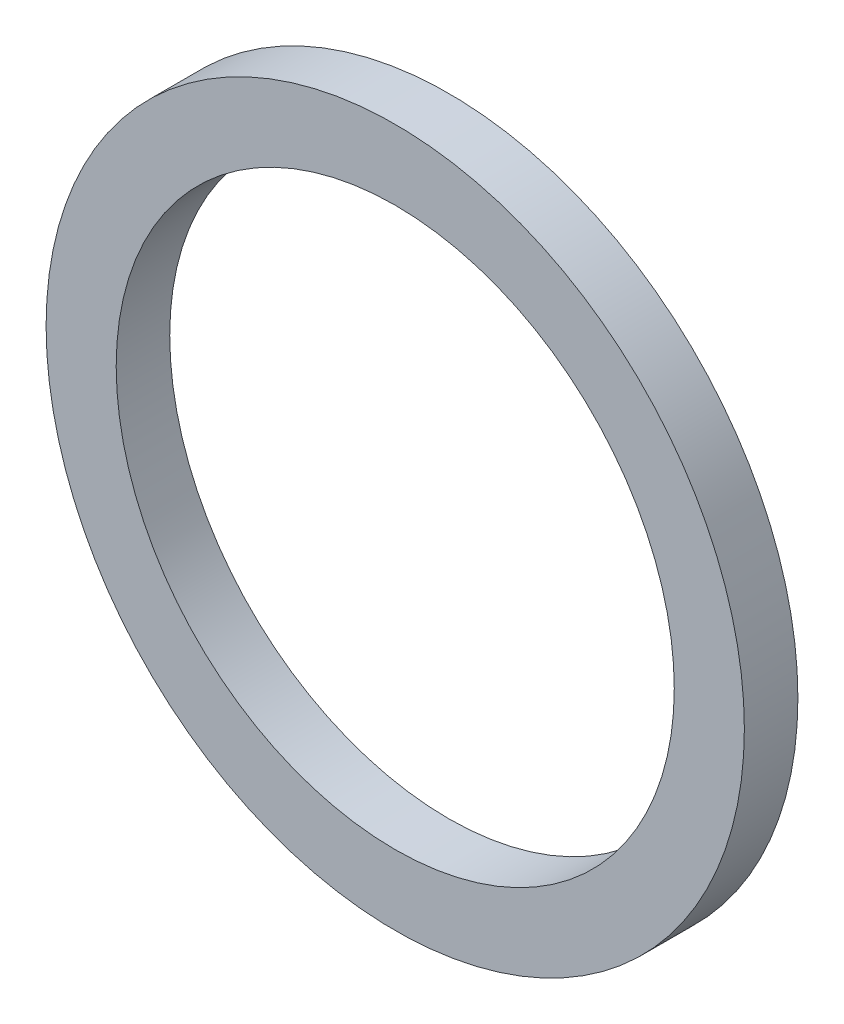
ISO-10303-21;
HEADER;
FILE_DESCRIPTION(('STEP AP214'),'2;1');
FILE_NAME('part.step','',(''),(''),'','','');
FILE_SCHEMA(('AUTOMOTIVE_DESIGN { 1 0 10303 214 1 1 1 1 }'));
ENDSEC;
DATA;
#1=APPLICATION_CONTEXT('core data for automotive mechanical design processes');
#2=APPLICATION_PROTOCOL_DEFINITION('international standard','automotive_design',2000,#1);
#3=PRODUCT_CONTEXT('',#1,'mechanical');
#4=PRODUCT('Part','Part','',(#3));
#5=PRODUCT_RELATED_PRODUCT_CATEGORY('part','',(#4));
#6=PRODUCT_DEFINITION_FORMATION('','',#4);
#7=PRODUCT_DEFINITION_CONTEXT('part definition',#1,'design');
#8=PRODUCT_DEFINITION('design','',#6,#7);
#9=PRODUCT_DEFINITION_SHAPE('','',#8);
#10=(LENGTH_UNIT() NAMED_UNIT(*) SI_UNIT(.MILLI.,.METRE.));
#11=(NAMED_UNIT(*) PLANE_ANGLE_UNIT() SI_UNIT($,.RADIAN.));
#12=(NAMED_UNIT(*) SI_UNIT($,.STERADIAN.) SOLID_ANGLE_UNIT());
#13=UNCERTAINTY_MEASURE_WITH_UNIT(LENGTH_MEASURE(1.E-05),#10,'distance_accuracy_value','');
#14=(GEOMETRIC_REPRESENTATION_CONTEXT(3) GLOBAL_UNCERTAINTY_ASSIGNED_CONTEXT((#13)) GLOBAL_UNIT_ASSIGNED_CONTEXT((#10,
#11,#12)) REPRESENTATION_CONTEXT('',''));
#15=CARTESIAN_POINT('',(0.,0.,0.));
#16=DIRECTION('',(0.,0.,1.));
#17=DIRECTION('',(1.,0.,0.));
#18=AXIS2_PLACEMENT_3D('',#15,#16,#17);
#19=CARTESIAN_POINT('',(0.,0.,1.15));
#20=DIRECTION('',(0.,0.,-1.));
#21=DIRECTION('',(-1.,0.,0.));
#22=AXIS2_PLACEMENT_3D('',#19,#20,#21);
#23=CYLINDRICAL_SURFACE('',#22,7.5);
#24=CARTESIAN_POINT('',(0.,0.,1.15));
#25=DIRECTION('',(0.,0.,1.));
#26=DIRECTION('',(1.,0.,0.));
#27=AXIS2_PLACEMENT_3D('',#24,#25,#26);
#28=CIRCLE('',#27,7.5);
#29=CARTESIAN_POINT('',(7.5,0.,1.15));
#30=VERTEX_POINT('',#29);
#31=EDGE_CURVE('E10',#30,#30,#28,.T.);
#32=ORIENTED_EDGE('',*,*,#31,.F.);
#33=EDGE_LOOP('',(#32));
#34=FACE_BOUND('',#33,.T.);
#35=CARTESIAN_POINT('',(0.,0.,0.));
#36=DIRECTION('',(0.,0.,1.));
#37=DIRECTION('',(1.,0.,0.));
#38=AXIS2_PLACEMENT_3D('',#35,#36,#37);
#39=CIRCLE('',#38,7.5);
#40=CARTESIAN_POINT('',(7.5,0.,0.));
#41=VERTEX_POINT('',#40);
#42=EDGE_CURVE('E32',#41,#41,#39,.T.);
#43=ORIENTED_EDGE('',*,*,#42,.T.);
#44=EDGE_LOOP('',(#43));
#45=FACE_BOUND('',#44,.T.);
#46=ADVANCED_FACE('F29',(#34,#45),#23,.T.);
#47=CARTESIAN_POINT('',(0.,0.,1.15));
#48=DIRECTION('',(0.,0.,1.));
#49=DIRECTION('',(1.,0.,0.));
#50=AXIS2_PLACEMENT_3D('',#47,#48,#49);
#51=PLANE('',#50);
#52=CARTESIAN_POINT('',(0.,0.,1.15));
#53=DIRECTION('',(0.,0.,1.));
#54=DIRECTION('',(1.,0.,0.));
#55=AXIS2_PLACEMENT_3D('',#52,#53,#54);
#56=CIRCLE('',#55,5.9944);
#57=CARTESIAN_POINT('',(5.9944,0.,1.15));
#58=VERTEX_POINT('',#57);
#59=EDGE_CURVE('E43',#58,#58,#56,.T.);
#60=ORIENTED_EDGE('',*,*,#59,.F.);
#61=EDGE_LOOP('',(#60));
#62=FACE_BOUND('',#61,.T.);
#63=ORIENTED_EDGE('',*,*,#31,.T.);
#64=EDGE_LOOP('',(#63));
#65=FACE_BOUND('',#64,.T.);
#66=ADVANCED_FACE('F49',(#62,#65),#51,.T.);
#67=CARTESIAN_POINT('',(0.,0.,0.));
#68=DIRECTION('',(0.,0.,1.));
#69=DIRECTION('',(1.,0.,0.));
#70=AXIS2_PLACEMENT_3D('',#67,#68,#69);
#71=PLANE('',#70);
#72=CARTESIAN_POINT('',(0.,0.,0.));
#73=DIRECTION('',(0.,0.,1.));
#74=DIRECTION('',(1.,0.,0.));
#75=AXIS2_PLACEMENT_3D('',#72,#73,#74);
#76=CIRCLE('',#75,5.9944);
#77=CARTESIAN_POINT('',(5.9944,0.,0.));
#78=VERTEX_POINT('',#77);
#79=EDGE_CURVE('E39',#78,#78,#76,.F.);
#80=ORIENTED_EDGE('',*,*,#79,.F.);
#81=EDGE_LOOP('',(#80));
#82=FACE_BOUND('',#81,.T.);
#83=ORIENTED_EDGE('',*,*,#42,.F.);
#84=EDGE_LOOP('',(#83));
#85=FACE_BOUND('',#84,.T.);
#86=ADVANCED_FACE('F51',(#82,#85),#71,.F.);
#87=CARTESIAN_POINT('',(0.,0.,-16.9547235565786));
#88=DIRECTION('',(0.,0.,1.));
#89=DIRECTION('',(1.,0.,0.));
#90=AXIS2_PLACEMENT_3D('',#87,#88,#89);
#91=CYLINDRICAL_SURFACE('',#90,5.9944);
#92=ORIENTED_EDGE('',*,*,#79,.T.);
#93=EDGE_LOOP('',(#92));
#94=FACE_BOUND('',#93,.T.);
#95=ORIENTED_EDGE('',*,*,#59,.T.);
#96=EDGE_LOOP('',(#95));
#97=FACE_BOUND('',#96,.T.);
#98=ADVANCED_FACE('F47',(#94,#97),#91,.F.);
#99=CLOSED_SHELL('',(#46,#66,#86,#98));
#100=MANIFOLD_SOLID_BREP('B2',#99);
#101=ADVANCED_BREP_SHAPE_REPRESENTATION('',(#18,#100),#14);
#102=SHAPE_DEFINITION_REPRESENTATION(#9,#101);
ENDSEC;
END-ISO-10303-21;
